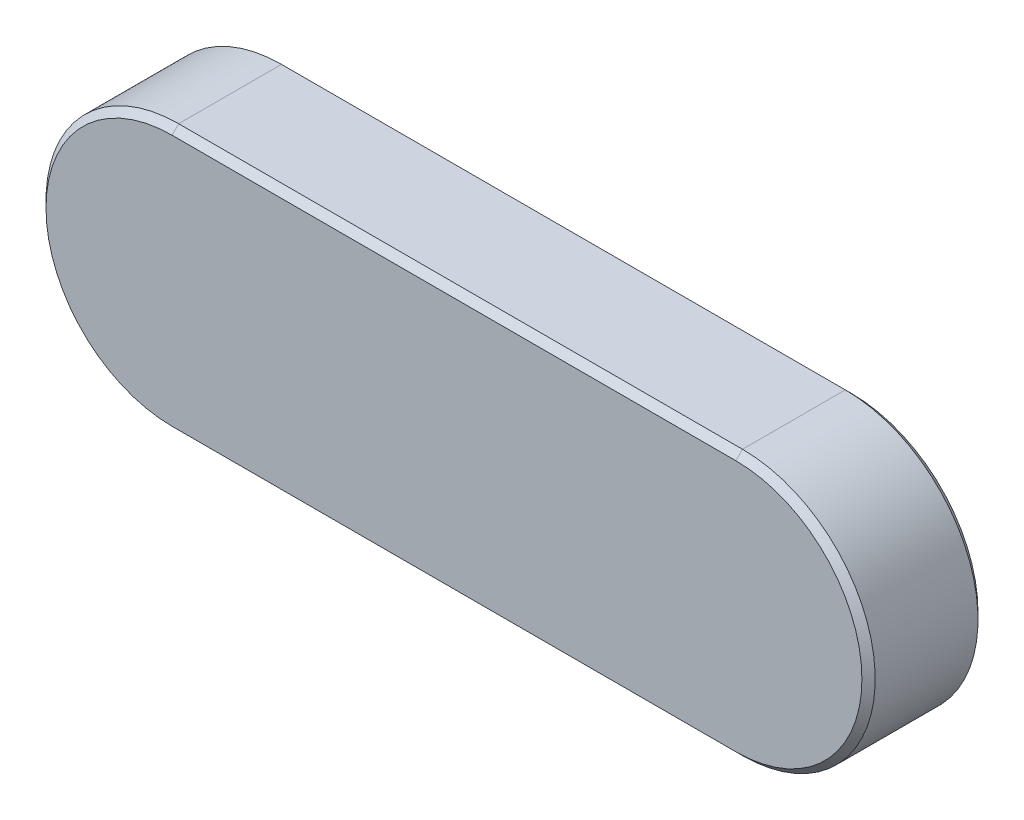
ISO-10303-21;
HEADER;
FILE_DESCRIPTION(('STEP AP214'),'2;1');
FILE_NAME('part.step','',(''),(''),'','','');
FILE_SCHEMA(('AUTOMOTIVE_DESIGN { 1 0 10303 214 1 1 1 1 }'));
ENDSEC;
DATA;
#1=APPLICATION_CONTEXT('core data for automotive mechanical design processes');
#2=APPLICATION_PROTOCOL_DEFINITION('international standard','automotive_design',2000,#1);
#3=PRODUCT_CONTEXT('',#1,'mechanical');
#4=PRODUCT('Part','Part','',(#3));
#5=PRODUCT_RELATED_PRODUCT_CATEGORY('part','',(#4));
#6=PRODUCT_DEFINITION_FORMATION('','',#4);
#7=PRODUCT_DEFINITION_CONTEXT('part definition',#1,'design');
#8=PRODUCT_DEFINITION('design','',#6,#7);
#9=PRODUCT_DEFINITION_SHAPE('','',#8);
#10=(LENGTH_UNIT() NAMED_UNIT(*) SI_UNIT(.MILLI.,.METRE.));
#11=(NAMED_UNIT(*) PLANE_ANGLE_UNIT() SI_UNIT($,.RADIAN.));
#12=(NAMED_UNIT(*) SI_UNIT($,.STERADIAN.) SOLID_ANGLE_UNIT());
#13=UNCERTAINTY_MEASURE_WITH_UNIT(LENGTH_MEASURE(1.E-05),#10,'distance_accuracy_value','');
#14=(GEOMETRIC_REPRESENTATION_CONTEXT(3) GLOBAL_UNCERTAINTY_ASSIGNED_CONTEXT((#13)) GLOBAL_UNIT_ASSIGNED_CONTEXT((#10,
#11,#12)) REPRESENTATION_CONTEXT('',''));
#15=CARTESIAN_POINT('',(0.,0.,0.));
#16=DIRECTION('',(0.,0.,1.));
#17=DIRECTION('',(1.,0.,0.));
#18=AXIS2_PLACEMENT_3D('',#15,#16,#17);
#19=CARTESIAN_POINT('',(-17.,0.,3.5));
#20=DIRECTION('',(0.,0.,-1.));
#21=DIRECTION('',(-1.,0.,0.));
#22=AXIS2_PLACEMENT_3D('',#19,#20,#21);
#23=CYLINDRICAL_SURFACE('',#22,7.99999999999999);
#24=DIRECTION('',(0.,0.,-1.));
#25=VECTOR('',#24,1.);
#26=CARTESIAN_POINT('',(-17.,7.99999999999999,3.5));
#27=LINE('',#26,#25);
#28=CARTESIAN_POINT('',(-17.,7.99999999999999,3.1));
#29=VERTEX_POINT('',#28);
#30=CARTESIAN_POINT('',(-17.,7.99999999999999,-3.1));
#31=VERTEX_POINT('',#30);
#32=EDGE_CURVE('E126',#29,#31,#27,.T.);
#33=ORIENTED_EDGE('',*,*,#32,.T.);
#34=CARTESIAN_POINT('',(-17.,0.,-3.1));
#35=DIRECTION('',(0.,0.,1.));
#36=DIRECTION('',(1.,0.,0.));
#37=AXIS2_PLACEMENT_3D('',#34,#35,#36);
#38=CIRCLE('',#37,7.99999999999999);
#39=CARTESIAN_POINT('',(-17.,-7.99999999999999,-3.1));
#40=VERTEX_POINT('',#39);
#41=EDGE_CURVE('E153',#31,#40,#38,.T.);
#42=ORIENTED_EDGE('',*,*,#41,.T.);
#43=DIRECTION('',(0.,0.,-1.));
#44=VECTOR('',#43,1.);
#45=CARTESIAN_POINT('',(-17.,-7.99999999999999,3.5));
#46=LINE('',#45,#44);
#47=CARTESIAN_POINT('',(-17.,-7.99999999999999,3.1));
#48=VERTEX_POINT('',#47);
#49=EDGE_CURVE('E120',#48,#40,#46,.T.);
#50=ORIENTED_EDGE('',*,*,#49,.F.);
#51=CARTESIAN_POINT('',(-17.,0.,3.1));
#52=DIRECTION('',(0.,0.,1.));
#53=DIRECTION('',(1.,0.,0.));
#54=AXIS2_PLACEMENT_3D('',#51,#52,#53);
#55=CIRCLE('',#54,7.99999999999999);
#56=EDGE_CURVE('E123',#48,#29,#55,.F.);
#57=ORIENTED_EDGE('',*,*,#56,.T.);
#58=EDGE_LOOP('',(#33,#42,#50,#57));
#59=FACE_BOUND('',#58,.T.);
#60=ADVANCED_FACE('F32',(#59),#23,.T.);
#61=CARTESIAN_POINT('',(-17.,-7.99999999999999,3.5));
#62=DIRECTION('',(0.,1.,0.));
#63=DIRECTION('',(-1.,0.,0.));
#64=AXIS2_PLACEMENT_3D('',#61,#62,#63);
#65=PLANE('',#64);
#66=ORIENTED_EDGE('',*,*,#49,.T.);
#67=DIRECTION('',(1.,0.,0.));
#68=VECTOR('',#67,1.);
#69=CARTESIAN_POINT('',(-17.,-7.99999999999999,-3.1));
#70=LINE('',#69,#68);
#71=CARTESIAN_POINT('',(17.,-7.99999999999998,-3.1));
#72=VERTEX_POINT('',#71);
#73=EDGE_CURVE('E11',#40,#72,#70,.T.);
#74=ORIENTED_EDGE('',*,*,#73,.T.);
#75=DIRECTION('',(0.,0.,-1.));
#76=VECTOR('',#75,1.);
#77=CARTESIAN_POINT('',(17.,-7.99999999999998,3.5));
#78=LINE('',#77,#76);
#79=CARTESIAN_POINT('',(17.,-7.99999999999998,3.1));
#80=VERTEX_POINT('',#79);
#81=EDGE_CURVE('E174',#80,#72,#78,.T.);
#82=ORIENTED_EDGE('',*,*,#81,.F.);
#83=DIRECTION('',(-1.,0.,0.));
#84=VECTOR('',#83,1.);
#85=CARTESIAN_POINT('',(-17.,-7.99999999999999,3.1));
#86=LINE('',#85,#84);
#87=EDGE_CURVE('E41',#80,#48,#86,.T.);
#88=ORIENTED_EDGE('',*,*,#87,.T.);
#89=EDGE_LOOP('',(#66,#74,#82,#88));
#90=FACE_BOUND('',#89,.T.);
#91=ADVANCED_FACE('F200',(#90),#65,.F.);
#92=CARTESIAN_POINT('',(17.,0.,3.5));
#93=DIRECTION('',(0.,0.,-1.));
#94=DIRECTION('',(-1.,0.,0.));
#95=AXIS2_PLACEMENT_3D('',#92,#93,#94);
#96=CYLINDRICAL_SURFACE('',#95,7.99999999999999);
#97=ORIENTED_EDGE('',*,*,#81,.T.);
#98=CARTESIAN_POINT('',(17.,0.,-3.1));
#99=DIRECTION('',(0.,0.,1.));
#100=DIRECTION('',(1.,0.,0.));
#101=AXIS2_PLACEMENT_3D('',#98,#99,#100);
#102=CIRCLE('',#101,7.99999999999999);
#103=CARTESIAN_POINT('',(17.,8.,-3.1));
#104=VERTEX_POINT('',#103);
#105=EDGE_CURVE('E150',#72,#104,#102,.T.);
#106=ORIENTED_EDGE('',*,*,#105,.T.);
#107=DIRECTION('',(0.,0.,-1.));
#108=VECTOR('',#107,1.);
#109=CARTESIAN_POINT('',(17.,8.,3.5));
#110=LINE('',#109,#108);
#111=CARTESIAN_POINT('',(17.,8.,3.1));
#112=VERTEX_POINT('',#111);
#113=EDGE_CURVE('E176',#112,#104,#110,.T.);
#114=ORIENTED_EDGE('',*,*,#113,.F.);
#115=CARTESIAN_POINT('',(17.,0.,3.1));
#116=DIRECTION('',(0.,0.,1.));
#117=DIRECTION('',(1.,0.,0.));
#118=AXIS2_PLACEMENT_3D('',#115,#116,#117);
#119=CIRCLE('',#118,7.99999999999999);
#120=EDGE_CURVE('E54',#112,#80,#119,.F.);
#121=ORIENTED_EDGE('',*,*,#120,.T.);
#122=EDGE_LOOP('',(#97,#106,#114,#121));
#123=FACE_BOUND('',#122,.T.);
#124=ADVANCED_FACE('F205',(#123),#96,.T.);
#125=CARTESIAN_POINT('',(-17.,7.99999999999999,3.5));
#126=DIRECTION('',(0.,-1.,0.));
#127=DIRECTION('',(1.,0.,0.));
#128=AXIS2_PLACEMENT_3D('',#125,#126,#127);
#129=PLANE('',#128);
#130=ORIENTED_EDGE('',*,*,#32,.F.);
#131=DIRECTION('',(1.,0.,0.));
#132=VECTOR('',#131,1.);
#133=CARTESIAN_POINT('',(17.,8.,3.1));
#134=LINE('',#133,#132);
#135=EDGE_CURVE('E165',#29,#112,#134,.T.);
#136=ORIENTED_EDGE('',*,*,#135,.T.);
#137=ORIENTED_EDGE('',*,*,#113,.T.);
#138=DIRECTION('',(-1.,0.,0.));
#139=VECTOR('',#138,1.);
#140=CARTESIAN_POINT('',(-17.,7.99999999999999,-3.1));
#141=LINE('',#140,#139);
#142=EDGE_CURVE('E168',#104,#31,#141,.T.);
#143=ORIENTED_EDGE('',*,*,#142,.T.);
#144=EDGE_LOOP('',(#130,#136,#137,#143));
#145=FACE_BOUND('',#144,.T.);
#146=ADVANCED_FACE('F184',(#145),#129,.F.);
#147=CARTESIAN_POINT('',(-17.,0.,3.5));
#148=DIRECTION('',(0.,0.,1.));
#149=DIRECTION('',(1.,0.,0.));
#150=AXIS2_PLACEMENT_3D('',#147,#148,#149);
#151=PLANE('',#150);
#152=CARTESIAN_POINT('',(17.,0.,3.5));
#153=DIRECTION('',(0.,0.,1.));
#154=DIRECTION('',(1.,0.,0.));
#155=AXIS2_PLACEMENT_3D('',#152,#153,#154);
#156=CIRCLE('',#155,7.6);
#157=CARTESIAN_POINT('',(17.,-7.59999999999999,3.5));
#158=VERTEX_POINT('',#157);
#159=CARTESIAN_POINT('',(17.,7.60000000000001,3.5));
#160=VERTEX_POINT('',#159);
#161=EDGE_CURVE('E109',#158,#160,#156,.T.);
#162=ORIENTED_EDGE('',*,*,#161,.T.);
#163=DIRECTION('',(-1.,0.,0.));
#164=VECTOR('',#163,1.);
#165=CARTESIAN_POINT('',(-17.,7.6,3.5));
#166=LINE('',#165,#164);
#167=CARTESIAN_POINT('',(-17.,7.6,3.5));
#168=VERTEX_POINT('',#167);
#169=EDGE_CURVE('E105',#160,#168,#166,.T.);
#170=ORIENTED_EDGE('',*,*,#169,.T.);
#171=CARTESIAN_POINT('',(-17.,0.,3.5));
#172=DIRECTION('',(0.,0.,1.));
#173=DIRECTION('',(1.,0.,0.));
#174=AXIS2_PLACEMENT_3D('',#171,#172,#173);
#175=CIRCLE('',#174,7.6);
#176=CARTESIAN_POINT('',(-17.,-7.6,3.5));
#177=VERTEX_POINT('',#176);
#178=EDGE_CURVE('E99',#168,#177,#175,.T.);
#179=ORIENTED_EDGE('',*,*,#178,.T.);
#180=DIRECTION('',(1.,0.,0.));
#181=VECTOR('',#180,1.);
#182=CARTESIAN_POINT('',(17.,-7.59999999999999,3.5));
#183=LINE('',#182,#181);
#184=EDGE_CURVE('E102',#177,#158,#183,.T.);
#185=ORIENTED_EDGE('',*,*,#184,.T.);
#186=EDGE_LOOP('',(#162,#170,#179,#185));
#187=FACE_BOUND('',#186,.T.);
#188=ADVANCED_FACE('F101',(#187),#151,.T.);
#189=CARTESIAN_POINT('',(-17.,0.,-3.5));
#190=DIRECTION('',(0.,0.,1.));
#191=DIRECTION('',(1.,0.,0.));
#192=AXIS2_PLACEMENT_3D('',#189,#190,#191);
#193=PLANE('',#192);
#194=CARTESIAN_POINT('',(-17.,0.,-3.5));
#195=DIRECTION('',(0.,0.,1.));
#196=DIRECTION('',(1.,0.,0.));
#197=AXIS2_PLACEMENT_3D('',#194,#195,#196);
#198=CIRCLE('',#197,7.59999999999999);
#199=CARTESIAN_POINT('',(-17.,-7.59999999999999,-3.5));
#200=VERTEX_POINT('',#199);
#201=CARTESIAN_POINT('',(-17.,7.6,-3.5));
#202=VERTEX_POINT('',#201);
#203=EDGE_CURVE('E159',#200,#202,#198,.F.);
#204=ORIENTED_EDGE('',*,*,#203,.T.);
#205=DIRECTION('',(1.,0.,0.));
#206=VECTOR('',#205,1.);
#207=CARTESIAN_POINT('',(-17.,7.59999999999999,-3.5));
#208=LINE('',#207,#206);
#209=CARTESIAN_POINT('',(17.,7.6,-3.5));
#210=VERTEX_POINT('',#209);
#211=EDGE_CURVE('E156',#202,#210,#208,.T.);
#212=ORIENTED_EDGE('',*,*,#211,.T.);
#213=CARTESIAN_POINT('',(17.,0.,-3.5));
#214=DIRECTION('',(0.,0.,1.));
#215=DIRECTION('',(1.,0.,0.));
#216=AXIS2_PLACEMENT_3D('',#213,#214,#215);
#217=CIRCLE('',#216,7.59999999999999);
#218=CARTESIAN_POINT('',(17.,-7.59999999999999,-3.5));
#219=VERTEX_POINT('',#218);
#220=EDGE_CURVE('E161',#210,#219,#217,.F.);
#221=ORIENTED_EDGE('',*,*,#220,.T.);
#222=DIRECTION('',(-1.,0.,0.));
#223=VECTOR('',#222,1.);
#224=CARTESIAN_POINT('',(-17.,-7.59999999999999,-3.5));
#225=LINE('',#224,#223);
#226=EDGE_CURVE('E163',#219,#200,#225,.T.);
#227=ORIENTED_EDGE('',*,*,#226,.T.);
#228=EDGE_LOOP('',(#204,#212,#221,#227));
#229=FACE_BOUND('',#228,.T.);
#230=ADVANCED_FACE('F197',(#229),#193,.F.);
#231=CARTESIAN_POINT('',(-17.,-7.6,3.5));
#232=DIRECTION('',(0.,-0.707106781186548,0.707106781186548));
#233=DIRECTION('',(0.,-0.707106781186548,-0.707106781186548));
#234=AXIS2_PLACEMENT_3D('',#231,#232,#233);
#235=PLANE('',#234);
#236=DIRECTION('',(0.,0.707106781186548,0.707106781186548));
#237=VECTOR('',#236,1.);
#238=CARTESIAN_POINT('',(-17.,-7.99999999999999,3.1));
#239=LINE('',#238,#237);
#240=EDGE_CURVE('E115',#48,#177,#239,.T.);
#241=ORIENTED_EDGE('',*,*,#240,.F.);
#242=ORIENTED_EDGE('',*,*,#87,.F.);
#243=DIRECTION('',(0.,-0.707106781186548,-0.707106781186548));
#244=VECTOR('',#243,1.);
#245=CARTESIAN_POINT('',(17.,-7.59999999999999,3.5));
#246=LINE('',#245,#244);
#247=EDGE_CURVE('E118',#158,#80,#246,.T.);
#248=ORIENTED_EDGE('',*,*,#247,.F.);
#249=ORIENTED_EDGE('',*,*,#184,.F.);
#250=EDGE_LOOP('',(#241,#242,#248,#249));
#251=FACE_BOUND('',#250,.T.);
#252=ADVANCED_FACE('F113',(#251),#235,.T.);
#253=CARTESIAN_POINT('',(17.,0.,3.5));
#254=DIRECTION('',(0.,0.,-1.));
#255=DIRECTION('',(-1.,0.,0.));
#256=AXIS2_PLACEMENT_3D('',#253,#254,#255);
#257=CONICAL_SURFACE('',#256,7.6,0.785398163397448);
#258=ORIENTED_EDGE('',*,*,#247,.T.);
#259=ORIENTED_EDGE('',*,*,#120,.F.);
#260=DIRECTION('',(0.,0.707106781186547,-0.707106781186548));
#261=VECTOR('',#260,1.);
#262=CARTESIAN_POINT('',(17.,7.60000000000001,3.5));
#263=LINE('',#262,#261);
#264=EDGE_CURVE('E124',#160,#112,#263,.T.);
#265=ORIENTED_EDGE('',*,*,#264,.F.);
#266=ORIENTED_EDGE('',*,*,#161,.F.);
#267=EDGE_LOOP('',(#258,#259,#265,#266));
#268=FACE_BOUND('',#267,.T.);
#269=ADVANCED_FACE('F189',(#268),#257,.T.);
#270=CARTESIAN_POINT('',(-17.,0.,3.5));
#271=DIRECTION('',(0.,0.,-1.));
#272=DIRECTION('',(-1.,0.,0.));
#273=AXIS2_PLACEMENT_3D('',#270,#271,#272);
#274=CONICAL_SURFACE('',#273,7.6,0.785398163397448);
#275=ORIENTED_EDGE('',*,*,#240,.T.);
#276=ORIENTED_EDGE('',*,*,#178,.F.);
#277=DIRECTION('',(0.,-0.707106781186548,0.707106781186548));
#278=VECTOR('',#277,1.);
#279=CARTESIAN_POINT('',(-17.,8.,3.1));
#280=LINE('',#279,#278);
#281=EDGE_CURVE('E128',#29,#168,#280,.T.);
#282=ORIENTED_EDGE('',*,*,#281,.F.);
#283=ORIENTED_EDGE('',*,*,#56,.F.);
#284=EDGE_LOOP('',(#275,#276,#282,#283));
#285=FACE_BOUND('',#284,.T.);
#286=ADVANCED_FACE('F122',(#285),#274,.T.);
#287=CARTESIAN_POINT('',(-17.,7.6,3.5));
#288=DIRECTION('',(0.,0.707106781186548,0.707106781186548));
#289=DIRECTION('',(0.,-0.707106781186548,0.707106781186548));
#290=AXIS2_PLACEMENT_3D('',#287,#288,#289);
#291=PLANE('',#290);
#292=ORIENTED_EDGE('',*,*,#264,.T.);
#293=ORIENTED_EDGE('',*,*,#135,.F.);
#294=ORIENTED_EDGE('',*,*,#281,.T.);
#295=ORIENTED_EDGE('',*,*,#169,.F.);
#296=EDGE_LOOP('',(#292,#293,#294,#295));
#297=FACE_BOUND('',#296,.T.);
#298=ADVANCED_FACE('F186',(#297),#291,.T.);
#299=CARTESIAN_POINT('',(-17.,-7.99999999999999,-3.1));
#300=DIRECTION('',(0.,0.707106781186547,0.707106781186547));
#301=DIRECTION('',(0.,-0.707106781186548,0.707106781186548));
#302=AXIS2_PLACEMENT_3D('',#299,#300,#301);
#303=PLANE('',#302);
#304=DIRECTION('',(0.,-0.707106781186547,0.707106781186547));
#305=VECTOR('',#304,1.);
#306=CARTESIAN_POINT('',(-17.,-7.59999999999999,-3.5));
#307=LINE('',#306,#305);
#308=EDGE_CURVE('E135',#200,#40,#307,.T.);
#309=ORIENTED_EDGE('',*,*,#308,.F.);
#310=ORIENTED_EDGE('',*,*,#226,.F.);
#311=DIRECTION('',(0.,0.707106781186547,-0.707106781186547));
#312=VECTOR('',#311,1.);
#313=CARTESIAN_POINT('',(17.,-7.99999999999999,-3.1));
#314=LINE('',#313,#312);
#315=EDGE_CURVE('E36',#72,#219,#314,.T.);
#316=ORIENTED_EDGE('',*,*,#315,.F.);
#317=ORIENTED_EDGE('',*,*,#73,.F.);
#318=EDGE_LOOP('',(#309,#310,#316,#317));
#319=FACE_BOUND('',#318,.T.);
#320=ADVANCED_FACE('F34',(#319),#303,.F.);
#321=CARTESIAN_POINT('',(17.,0.,-3.1));
#322=DIRECTION('',(0.,0.,1.));
#323=DIRECTION('',(1.,0.,0.));
#324=AXIS2_PLACEMENT_3D('',#321,#322,#323);
#325=CONICAL_SURFACE('',#324,7.99999999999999,0.785398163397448);
#326=ORIENTED_EDGE('',*,*,#315,.T.);
#327=ORIENTED_EDGE('',*,*,#220,.F.);
#328=DIRECTION('',(0.,-0.707106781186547,-0.707106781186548));
#329=VECTOR('',#328,1.);
#330=CARTESIAN_POINT('',(17.,8.,-3.1));
#331=LINE('',#330,#329);
#332=EDGE_CURVE('E134',#104,#210,#331,.T.);
#333=ORIENTED_EDGE('',*,*,#332,.F.);
#334=ORIENTED_EDGE('',*,*,#105,.F.);
#335=EDGE_LOOP('',(#326,#327,#333,#334));
#336=FACE_BOUND('',#335,.T.);
#337=ADVANCED_FACE('F213',(#336),#325,.T.);
#338=CARTESIAN_POINT('',(-17.,0.,-3.1));
#339=DIRECTION('',(0.,0.,1.));
#340=DIRECTION('',(1.,0.,0.));
#341=AXIS2_PLACEMENT_3D('',#338,#339,#340);
#342=CONICAL_SURFACE('',#341,7.99999999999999,0.785398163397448);
#343=ORIENTED_EDGE('',*,*,#308,.T.);
#344=ORIENTED_EDGE('',*,*,#41,.F.);
#345=DIRECTION('',(0.,0.707106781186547,0.707106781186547));
#346=VECTOR('',#345,1.);
#347=CARTESIAN_POINT('',(-17.,7.6,-3.5));
#348=LINE('',#347,#346);
#349=EDGE_CURVE('E132',#202,#31,#348,.T.);
#350=ORIENTED_EDGE('',*,*,#349,.F.);
#351=ORIENTED_EDGE('',*,*,#203,.F.);
#352=EDGE_LOOP('',(#343,#344,#350,#351));
#353=FACE_BOUND('',#352,.T.);
#354=ADVANCED_FACE('F218',(#353),#342,.T.);
#355=CARTESIAN_POINT('',(-17.,7.99999999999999,-3.1));
#356=DIRECTION('',(0.,-0.707106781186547,0.707106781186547));
#357=DIRECTION('',(0.,-0.707106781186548,-0.707106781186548));
#358=AXIS2_PLACEMENT_3D('',#355,#356,#357);
#359=PLANE('',#358);
#360=ORIENTED_EDGE('',*,*,#332,.T.);
#361=ORIENTED_EDGE('',*,*,#211,.F.);
#362=ORIENTED_EDGE('',*,*,#349,.T.);
#363=ORIENTED_EDGE('',*,*,#142,.F.);
#364=EDGE_LOOP('',(#360,#361,#362,#363));
#365=FACE_BOUND('',#364,.T.);
#366=ADVANCED_FACE('F224',(#365),#359,.F.);
#367=CLOSED_SHELL('',(#60,#91,#124,#146,#188,#230,#252,#269,#286,#298,#320,#337,#354,#366));
#368=MANIFOLD_SOLID_BREP('B2',#367);
#369=ADVANCED_BREP_SHAPE_REPRESENTATION('',(#18,#368),#14);
#370=SHAPE_DEFINITION_REPRESENTATION(#9,#369);
ENDSEC;
END-ISO-10303-21;
